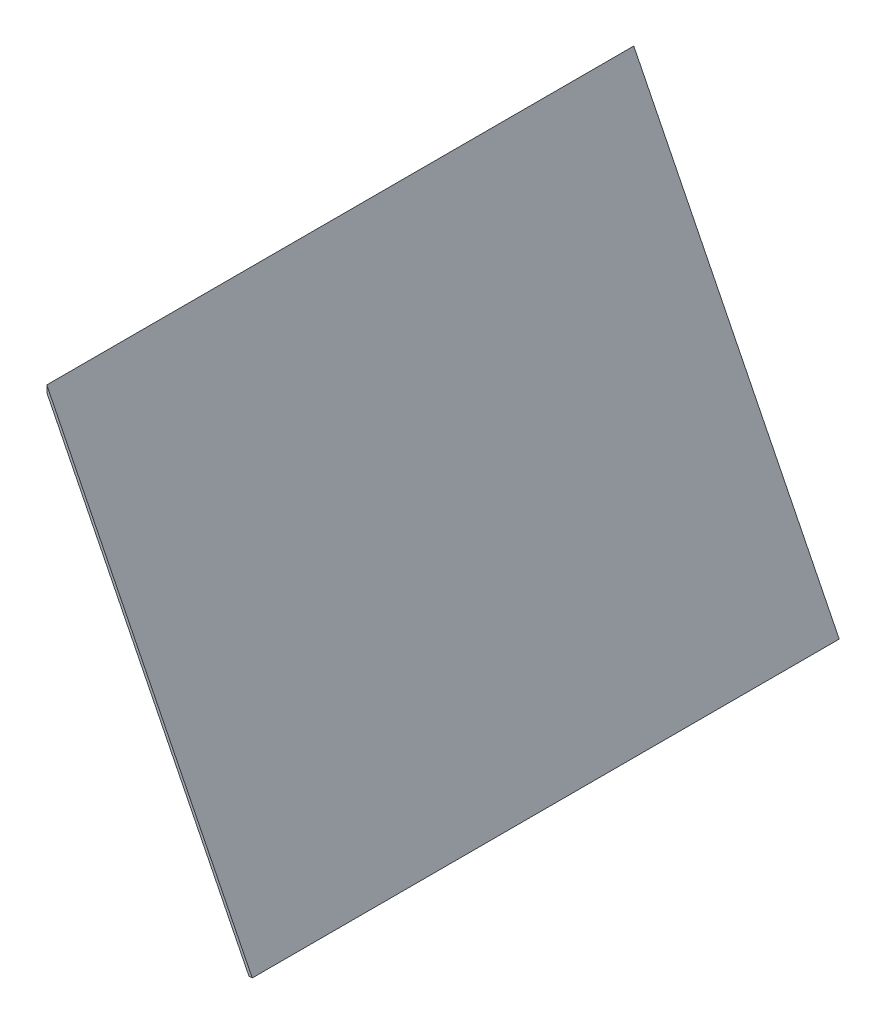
ISO-10303-21;
HEADER;
FILE_DESCRIPTION(('STEP AP214'),'2;1');
FILE_NAME('part.step','',(''),(''),'','','');
FILE_SCHEMA(('AUTOMOTIVE_DESIGN { 1 0 10303 214 1 1 1 1 }'));
ENDSEC;
DATA;
#1=APPLICATION_CONTEXT('core data for automotive mechanical design processes');
#2=APPLICATION_PROTOCOL_DEFINITION('international standard','automotive_design',2000,#1);
#3=PRODUCT_CONTEXT('',#1,'mechanical');
#4=PRODUCT('Part','Part','',(#3));
#5=PRODUCT_RELATED_PRODUCT_CATEGORY('part','',(#4));
#6=PRODUCT_DEFINITION_FORMATION('','',#4);
#7=PRODUCT_DEFINITION_CONTEXT('part definition',#1,'design');
#8=PRODUCT_DEFINITION('design','',#6,#7);
#9=PRODUCT_DEFINITION_SHAPE('','',#8);
#10=(LENGTH_UNIT() NAMED_UNIT(*) SI_UNIT(.MILLI.,.METRE.));
#11=(NAMED_UNIT(*) PLANE_ANGLE_UNIT() SI_UNIT($,.RADIAN.));
#12=(NAMED_UNIT(*) SI_UNIT($,.STERADIAN.) SOLID_ANGLE_UNIT());
#13=UNCERTAINTY_MEASURE_WITH_UNIT(LENGTH_MEASURE(1.E-05),#10,'distance_accuracy_value','');
#14=(GEOMETRIC_REPRESENTATION_CONTEXT(3) GLOBAL_UNCERTAINTY_ASSIGNED_CONTEXT((#13)) GLOBAL_UNIT_ASSIGNED_CONTEXT((#10,
#11,#12)) REPRESENTATION_CONTEXT('',''));
#15=CARTESIAN_POINT('',(0.,0.,0.));
#16=DIRECTION('',(0.,0.,1.));
#17=DIRECTION('',(1.,0.,0.));
#18=AXIS2_PLACEMENT_3D('',#15,#16,#17);
#19=CARTESIAN_POINT('',(-0.420000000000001,-5.97333333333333,20.));
#20=DIRECTION('',(-0.894427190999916,-0.447213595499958,0.));
#21=DIRECTION('',(0.447213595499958,-0.894427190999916,0.));
#22=AXIS2_PLACEMENT_3D('',#19,#20,#21);
#23=PLANE('',#22);
#24=DIRECTION('',(-0.447213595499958,0.894427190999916,0.));
#25=VECTOR('',#24,1.);
#26=CARTESIAN_POINT('',(-0.420000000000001,-5.97333333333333,0.));
#27=LINE('',#26,#25);
#28=CARTESIAN_POINT('',(-0.420000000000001,-5.97333333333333,0.));
#29=VERTEX_POINT('',#28);
#30=CARTESIAN_POINT('',(-7.42,8.02666666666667,0.));
#31=VERTEX_POINT('',#30);
#32=EDGE_CURVE('E85',#29,#31,#27,.T.);
#33=ORIENTED_EDGE('',*,*,#32,.T.);
#34=DIRECTION('',(0.,0.,-1.));
#35=VECTOR('',#34,1.);
#36=CARTESIAN_POINT('',(-7.42,8.02666666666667,20.));
#37=LINE('',#36,#35);
#38=CARTESIAN_POINT('',(-7.42,8.02666666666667,20.));
#39=VERTEX_POINT('',#38);
#40=EDGE_CURVE('E11',#39,#31,#37,.T.);
#41=ORIENTED_EDGE('',*,*,#40,.F.);
#42=DIRECTION('',(-0.447213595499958,0.894427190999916,0.));
#43=VECTOR('',#42,1.);
#44=CARTESIAN_POINT('',(-0.420000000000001,-5.97333333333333,20.));
#45=LINE('',#44,#43);
#46=CARTESIAN_POINT('',(-0.420000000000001,-5.97333333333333,20.));
#47=VERTEX_POINT('',#46);
#48=EDGE_CURVE('E79',#47,#39,#45,.T.);
#49=ORIENTED_EDGE('',*,*,#48,.F.);
#50=DIRECTION('',(0.,0.,-1.));
#51=VECTOR('',#50,1.);
#52=CARTESIAN_POINT('',(-0.420000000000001,-5.97333333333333,20.));
#53=LINE('',#52,#51);
#54=EDGE_CURVE('E40',#47,#29,#53,.T.);
#55=ORIENTED_EDGE('',*,*,#54,.T.);
#56=EDGE_LOOP('',(#33,#41,#49,#55));
#57=FACE_BOUND('',#56,.T.);
#58=ADVANCED_FACE('F33',(#57),#23,.F.);
#59=CARTESIAN_POINT('',(-7.42,8.02666666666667,20.));
#60=DIRECTION('',(1.,0.,0.));
#61=DIRECTION('',(0.,0.,-1.));
#62=AXIS2_PLACEMENT_3D('',#59,#60,#61);
#63=PLANE('',#62);
#64=DIRECTION('',(0.,-1.,0.));
#65=VECTOR('',#64,1.);
#66=CARTESIAN_POINT('',(-7.42,8.02666666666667,0.));
#67=LINE('',#66,#65);
#68=CARTESIAN_POINT('',(-7.42,7.80164975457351,0.));
#69=VERTEX_POINT('',#68);
#70=EDGE_CURVE('E80',#31,#69,#67,.T.);
#71=ORIENTED_EDGE('',*,*,#70,.T.);
#72=DIRECTION('',(0.,0.,-1.));
#73=VECTOR('',#72,1.);
#74=CARTESIAN_POINT('',(-7.42,7.8016497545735,20.));
#75=LINE('',#74,#73);
#76=CARTESIAN_POINT('',(-7.42,7.8016497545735,20.));
#77=VERTEX_POINT('',#76);
#78=EDGE_CURVE('E47',#77,#69,#75,.T.);
#79=ORIENTED_EDGE('',*,*,#78,.F.);
#80=DIRECTION('',(0.,-1.,0.));
#81=VECTOR('',#80,1.);
#82=CARTESIAN_POINT('',(-7.42,8.02666666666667,20.));
#83=LINE('',#82,#81);
#84=EDGE_CURVE('E93',#39,#77,#83,.T.);
#85=ORIENTED_EDGE('',*,*,#84,.F.);
#86=ORIENTED_EDGE('',*,*,#40,.T.);
#87=EDGE_LOOP('',(#71,#79,#85,#86));
#88=FACE_BOUND('',#87,.T.);
#89=ADVANCED_FACE('F107',(#88),#63,.F.);
#90=CARTESIAN_POINT('',(-7.42,-5.97333333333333,20.));
#91=DIRECTION('',(0.,1.,0.));
#92=DIRECTION('',(0.,0.,1.));
#93=AXIS2_PLACEMENT_3D('',#90,#91,#92);
#94=PLANE('',#93);
#95=DIRECTION('',(1.,0.,0.));
#96=VECTOR('',#95,1.);
#97=CARTESIAN_POINT('',(-7.42,-5.97333333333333,20.));
#98=LINE('',#97,#96);
#99=CARTESIAN_POINT('',(-0.532508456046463,-5.97333333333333,20.));
#100=VERTEX_POINT('',#99);
#101=EDGE_CURVE('E56',#100,#47,#98,.T.);
#102=ORIENTED_EDGE('',*,*,#101,.F.);
#103=DIRECTION('',(0.,0.,-1.));
#104=VECTOR('',#103,1.);
#105=CARTESIAN_POINT('',(-0.532508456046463,-5.97333333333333,20.));
#106=LINE('',#105,#104);
#107=CARTESIAN_POINT('',(-0.532508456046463,-5.97333333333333,0.));
#108=VERTEX_POINT('',#107);
#109=EDGE_CURVE('E76',#100,#108,#106,.T.);
#110=ORIENTED_EDGE('',*,*,#109,.T.);
#111=DIRECTION('',(1.,0.,0.));
#112=VECTOR('',#111,1.);
#113=CARTESIAN_POINT('',(-7.42,-5.97333333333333,0.));
#114=LINE('',#113,#112);
#115=EDGE_CURVE('E70',#108,#29,#114,.T.);
#116=ORIENTED_EDGE('',*,*,#115,.T.);
#117=ORIENTED_EDGE('',*,*,#54,.F.);
#118=EDGE_LOOP('',(#102,#110,#116,#117));
#119=FACE_BOUND('',#118,.T.);
#120=ADVANCED_FACE('F72',(#119),#94,.F.);
#121=CARTESIAN_POINT('',(0.,0.,20.));
#122=DIRECTION('',(0.,0.,-1.));
#123=DIRECTION('',(-1.,0.,0.));
#124=AXIS2_PLACEMENT_3D('',#121,#122,#123);
#125=PLANE('',#124);
#126=ORIENTED_EDGE('',*,*,#84,.T.);
#127=DIRECTION('',(0.447213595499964,-0.894427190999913,0.));
#128=VECTOR('',#127,1.);
#129=CARTESIAN_POINT('',(-7.42,7.8016497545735,20.));
#130=LINE('',#129,#128);
#131=EDGE_CURVE('E98',#77,#100,#130,.T.);
#132=ORIENTED_EDGE('',*,*,#131,.T.);
#133=ORIENTED_EDGE('',*,*,#101,.T.);
#134=ORIENTED_EDGE('',*,*,#48,.T.);
#135=EDGE_LOOP('',(#126,#132,#133,#134));
#136=FACE_BOUND('',#135,.T.);
#137=ADVANCED_FACE('F102',(#136),#125,.F.);
#138=CARTESIAN_POINT('',(0.,0.,0.));
#139=DIRECTION('',(0.,0.,-1.));
#140=DIRECTION('',(-1.,0.,0.));
#141=AXIS2_PLACEMENT_3D('',#138,#139,#140);
#142=PLANE('',#141);
#143=DIRECTION('',(0.447213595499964,-0.894427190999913,0.));
#144=VECTOR('',#143,1.);
#145=CARTESIAN_POINT('',(-7.42,7.8016497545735,0.));
#146=LINE('',#145,#144);
#147=EDGE_CURVE('E99',#69,#108,#146,.T.);
#148=ORIENTED_EDGE('',*,*,#147,.F.);
#149=ORIENTED_EDGE('',*,*,#70,.F.);
#150=ORIENTED_EDGE('',*,*,#32,.F.);
#151=ORIENTED_EDGE('',*,*,#115,.F.);
#152=EDGE_LOOP('',(#148,#149,#150,#151));
#153=FACE_BOUND('',#152,.T.);
#154=ADVANCED_FACE('F86',(#153),#142,.T.);
#155=CARTESIAN_POINT('',(-7.42,7.8016497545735,20.));
#156=DIRECTION('',(0.894427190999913,0.447213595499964,0.));
#157=DIRECTION('',(-0.447213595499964,0.894427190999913,0.));
#158=AXIS2_PLACEMENT_3D('',#155,#156,#157);
#159=PLANE('',#158);
#160=ORIENTED_EDGE('',*,*,#147,.T.);
#161=ORIENTED_EDGE('',*,*,#109,.F.);
#162=ORIENTED_EDGE('',*,*,#131,.F.);
#163=ORIENTED_EDGE('',*,*,#78,.T.);
#164=EDGE_LOOP('',(#160,#161,#162,#163));
#165=FACE_BOUND('',#164,.T.);
#166=ADVANCED_FACE('F104',(#165),#159,.F.);
#167=CLOSED_SHELL('',(#58,#89,#120,#137,#154,#166));
#168=MANIFOLD_SOLID_BREP('B2',#167);
#169=ADVANCED_BREP_SHAPE_REPRESENTATION('',(#18,#168),#14);
#170=SHAPE_DEFINITION_REPRESENTATION(#9,#169);
ENDSEC;
END-ISO-10303-21;
